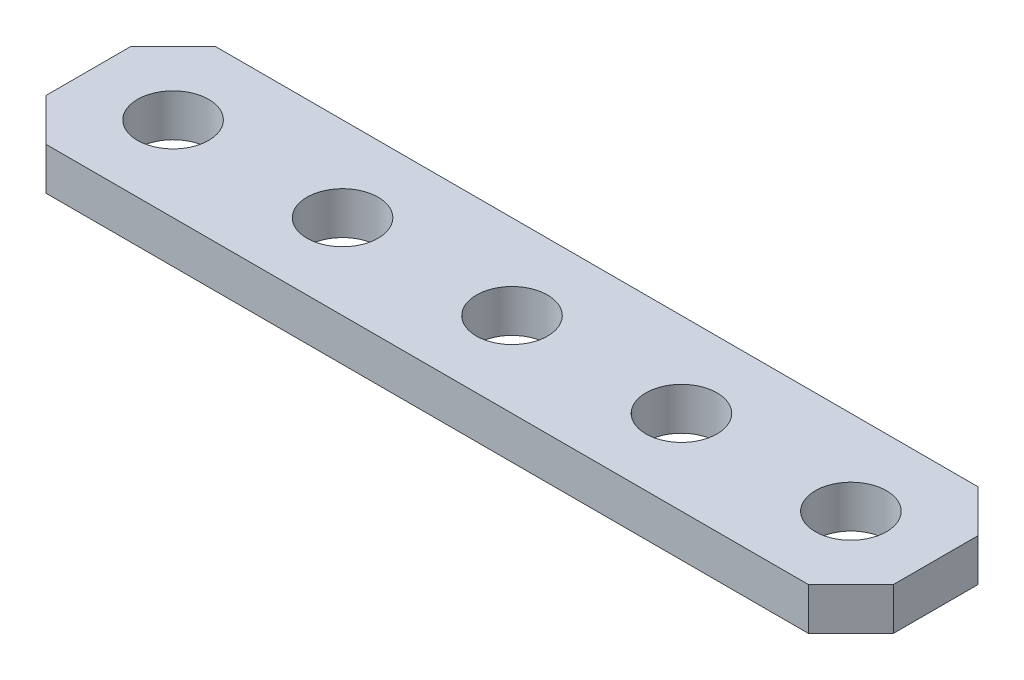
ISO-10303-21;
HEADER;
FILE_DESCRIPTION(('STEP AP214'),'2;1');
FILE_NAME('part.step','',(''),(''),'','','');
FILE_SCHEMA(('AUTOMOTIVE_DESIGN { 1 0 10303 214 1 1 1 1 }'));
ENDSEC;
DATA;
#1=APPLICATION_CONTEXT('core data for automotive mechanical design processes');
#2=APPLICATION_PROTOCOL_DEFINITION('international standard','automotive_design',2000,#1);
#3=PRODUCT_CONTEXT('',#1,'mechanical');
#4=PRODUCT('Part','Part','',(#3));
#5=PRODUCT_RELATED_PRODUCT_CATEGORY('part','',(#4));
#6=PRODUCT_DEFINITION_FORMATION('','',#4);
#7=PRODUCT_DEFINITION_CONTEXT('part definition',#1,'design');
#8=PRODUCT_DEFINITION('design','',#6,#7);
#9=PRODUCT_DEFINITION_SHAPE('','',#8);
#10=(LENGTH_UNIT() NAMED_UNIT(*) SI_UNIT(.MILLI.,.METRE.));
#11=(NAMED_UNIT(*) PLANE_ANGLE_UNIT() SI_UNIT($,.RADIAN.));
#12=(NAMED_UNIT(*) SI_UNIT($,.STERADIAN.) SOLID_ANGLE_UNIT());
#13=UNCERTAINTY_MEASURE_WITH_UNIT(LENGTH_MEASURE(1.E-05),#10,'distance_accuracy_value','');
#14=(GEOMETRIC_REPRESENTATION_CONTEXT(3) GLOBAL_UNCERTAINTY_ASSIGNED_CONTEXT((#13)) GLOBAL_UNIT_ASSIGNED_CONTEXT((#10,
#11,#12)) REPRESENTATION_CONTEXT('',''));
#15=CARTESIAN_POINT('',(0.,0.,0.));
#16=DIRECTION('',(0.,0.,1.));
#17=DIRECTION('',(1.,0.,0.));
#18=AXIS2_PLACEMENT_3D('',#15,#16,#17);
#19=CARTESIAN_POINT('',(0.,3.175,0.));
#20=DIRECTION('',(0.,0.,-1.));
#21=DIRECTION('',(0.,-1.,0.));
#22=AXIS2_PLACEMENT_3D('',#19,#20,#21);
#23=PLANE('',#22);
#24=DIRECTION('',(1.,0.,0.));
#25=VECTOR('',#24,1.);
#26=CARTESIAN_POINT('',(0.,3.175,0.));
#27=LINE('',#26,#25);
#28=CARTESIAN_POINT('',(3.175,3.175,0.));
#29=VERTEX_POINT('',#28);
#30=CARTESIAN_POINT('',(60.325,3.175,0.));
#31=VERTEX_POINT('',#30);
#32=EDGE_CURVE('E158',#29,#31,#27,.T.);
#33=ORIENTED_EDGE('',*,*,#32,.F.);
#34=DIRECTION('',(0.,-1.,0.));
#35=VECTOR('',#34,1.);
#36=CARTESIAN_POINT('',(3.175,0.,0.));
#37=LINE('',#36,#35);
#38=CARTESIAN_POINT('',(3.175,0.,0.));
#39=VERTEX_POINT('',#38);
#40=EDGE_CURVE('E157',#29,#39,#37,.T.);
#41=ORIENTED_EDGE('',*,*,#40,.T.);
#42=DIRECTION('',(1.,0.,0.));
#43=VECTOR('',#42,1.);
#44=CARTESIAN_POINT('',(0.,0.,0.));
#45=LINE('',#44,#43);
#46=CARTESIAN_POINT('',(60.325,0.,0.));
#47=VERTEX_POINT('',#46);
#48=EDGE_CURVE('E140',#39,#47,#45,.T.);
#49=ORIENTED_EDGE('',*,*,#48,.T.);
#50=DIRECTION('',(0.,1.,0.));
#51=VECTOR('',#50,1.);
#52=CARTESIAN_POINT('',(60.325,3.175,0.));
#53=LINE('',#52,#51);
#54=EDGE_CURVE('E416',#47,#31,#53,.T.);
#55=ORIENTED_EDGE('',*,*,#54,.T.);
#56=EDGE_LOOP('',(#33,#41,#49,#55));
#57=FACE_BOUND('',#56,.T.);
#58=ADVANCED_FACE('F17',(#57),#23,.F.);
#59=CARTESIAN_POINT('',(63.5,3.175,0.));
#60=DIRECTION('',(-1.,0.,0.));
#61=DIRECTION('',(0.,0.,1.));
#62=AXIS2_PLACEMENT_3D('',#59,#60,#61);
#63=PLANE('',#62);
#64=DIRECTION('',(0.,0.,-1.));
#65=VECTOR('',#64,1.);
#66=CARTESIAN_POINT('',(63.5,0.,0.));
#67=LINE('',#66,#65);
#68=CARTESIAN_POINT('',(63.5,0.,-3.175));
#69=VERTEX_POINT('',#68);
#70=CARTESIAN_POINT('',(63.5,0.,-9.525));
#71=VERTEX_POINT('',#70);
#72=EDGE_CURVE('E215',#69,#71,#67,.T.);
#73=ORIENTED_EDGE('',*,*,#72,.T.);
#74=DIRECTION('',(0.,1.,0.));
#75=VECTOR('',#74,1.);
#76=CARTESIAN_POINT('',(63.5,3.175,-9.525));
#77=LINE('',#76,#75);
#78=CARTESIAN_POINT('',(63.5,3.175,-9.525));
#79=VERTEX_POINT('',#78);
#80=EDGE_CURVE('E180',#71,#79,#77,.T.);
#81=ORIENTED_EDGE('',*,*,#80,.T.);
#82=DIRECTION('',(0.,0.,-1.));
#83=VECTOR('',#82,1.);
#84=CARTESIAN_POINT('',(63.5,3.175,0.));
#85=LINE('',#84,#83);
#86=CARTESIAN_POINT('',(63.5,3.175,-3.175));
#87=VERTEX_POINT('',#86);
#88=EDGE_CURVE('E238',#87,#79,#85,.T.);
#89=ORIENTED_EDGE('',*,*,#88,.F.);
#90=DIRECTION('',(0.,-1.,0.));
#91=VECTOR('',#90,1.);
#92=CARTESIAN_POINT('',(63.5,3.175,-3.175));
#93=LINE('',#92,#91);
#94=EDGE_CURVE('E176',#87,#69,#93,.T.);
#95=ORIENTED_EDGE('',*,*,#94,.T.);
#96=EDGE_LOOP('',(#73,#81,#89,#95));
#97=FACE_BOUND('',#96,.T.);
#98=ADVANCED_FACE('F266',(#97),#63,.F.);
#99=CARTESIAN_POINT('',(0.,3.175,-12.7));
#100=DIRECTION('',(0.,0.,-1.));
#101=DIRECTION('',(0.,-1.,0.));
#102=AXIS2_PLACEMENT_3D('',#99,#100,#101);
#103=PLANE('',#102);
#104=DIRECTION('',(1.,0.,0.));
#105=VECTOR('',#104,1.);
#106=CARTESIAN_POINT('',(0.,0.,-12.7));
#107=LINE('',#106,#105);
#108=CARTESIAN_POINT('',(3.175,0.,-12.7));
#109=VERTEX_POINT('',#108);
#110=CARTESIAN_POINT('',(60.325,0.,-12.7));
#111=VERTEX_POINT('',#110);
#112=EDGE_CURVE('E213',#109,#111,#107,.T.);
#113=ORIENTED_EDGE('',*,*,#112,.F.);
#114=DIRECTION('',(0.,1.,0.));
#115=VECTOR('',#114,1.);
#116=CARTESIAN_POINT('',(3.175,3.175,-12.7));
#117=LINE('',#116,#115);
#118=CARTESIAN_POINT('',(3.175,3.175,-12.7));
#119=VERTEX_POINT('',#118);
#120=EDGE_CURVE('E201',#109,#119,#117,.T.);
#121=ORIENTED_EDGE('',*,*,#120,.T.);
#122=DIRECTION('',(1.,0.,0.));
#123=VECTOR('',#122,1.);
#124=CARTESIAN_POINT('',(0.,3.175,-12.7));
#125=LINE('',#124,#123);
#126=CARTESIAN_POINT('',(60.325,3.175,-12.7));
#127=VERTEX_POINT('',#126);
#128=EDGE_CURVE('E241',#119,#127,#125,.T.);
#129=ORIENTED_EDGE('',*,*,#128,.T.);
#130=DIRECTION('',(0.,-1.,0.));
#131=VECTOR('',#130,1.);
#132=CARTESIAN_POINT('',(60.325,0.,-12.7));
#133=LINE('',#132,#131);
#134=EDGE_CURVE('E193',#127,#111,#133,.T.);
#135=ORIENTED_EDGE('',*,*,#134,.T.);
#136=EDGE_LOOP('',(#113,#121,#129,#135));
#137=FACE_BOUND('',#136,.T.);
#138=ADVANCED_FACE('F273',(#137),#103,.T.);
#139=CARTESIAN_POINT('',(0.,3.175,0.));
#140=DIRECTION('',(-1.,0.,0.));
#141=DIRECTION('',(0.,0.,1.));
#142=AXIS2_PLACEMENT_3D('',#139,#140,#141);
#143=PLANE('',#142);
#144=DIRECTION('',(0.,0.,-1.));
#145=VECTOR('',#144,1.);
#146=CARTESIAN_POINT('',(0.,0.,0.));
#147=LINE('',#146,#145);
#148=CARTESIAN_POINT('',(0.,0.,-3.175));
#149=VERTEX_POINT('',#148);
#150=CARTESIAN_POINT('',(0.,0.,-9.525));
#151=VERTEX_POINT('',#150);
#152=EDGE_CURVE('E153',#149,#151,#147,.T.);
#153=ORIENTED_EDGE('',*,*,#152,.F.);
#154=DIRECTION('',(0.,1.,0.));
#155=VECTOR('',#154,1.);
#156=CARTESIAN_POINT('',(0.,3.175,-3.175));
#157=LINE('',#156,#155);
#158=CARTESIAN_POINT('',(0.,3.175,-3.175));
#159=VERTEX_POINT('',#158);
#160=EDGE_CURVE('E166',#149,#159,#157,.T.);
#161=ORIENTED_EDGE('',*,*,#160,.T.);
#162=DIRECTION('',(0.,0.,-1.));
#163=VECTOR('',#162,1.);
#164=CARTESIAN_POINT('',(0.,3.175,0.));
#165=LINE('',#164,#163);
#166=CARTESIAN_POINT('',(0.,3.175,-9.525));
#167=VERTEX_POINT('',#166);
#168=EDGE_CURVE('E229',#159,#167,#165,.T.);
#169=ORIENTED_EDGE('',*,*,#168,.T.);
#170=DIRECTION('',(0.,-1.,0.));
#171=VECTOR('',#170,1.);
#172=CARTESIAN_POINT('',(0.,3.175,-9.525));
#173=LINE('',#172,#171);
#174=EDGE_CURVE('E212',#167,#151,#173,.T.);
#175=ORIENTED_EDGE('',*,*,#174,.T.);
#176=EDGE_LOOP('',(#153,#161,#169,#175));
#177=FACE_BOUND('',#176,.T.);
#178=ADVANCED_FACE('F19',(#177),#143,.T.);
#179=CARTESIAN_POINT('',(19.05,3.175,-6.35));
#180=DIRECTION('',(0.,-1.,0.));
#181=DIRECTION('',(0.,0.,-1.));
#182=AXIS2_PLACEMENT_3D('',#179,#180,#181);
#183=CYLINDRICAL_SURFACE('',#182,2.667);
#184=CARTESIAN_POINT('',(19.05,3.175,-6.35));
#185=DIRECTION('',(0.,1.,0.));
#186=DIRECTION('',(0.,0.,1.));
#187=AXIS2_PLACEMENT_3D('',#184,#185,#186);
#188=CIRCLE('',#187,2.667);
#189=CARTESIAN_POINT('',(19.05,3.175,-3.683));
#190=VERTEX_POINT('',#189);
#191=EDGE_CURVE('E235',#190,#190,#188,.T.);
#192=ORIENTED_EDGE('',*,*,#191,.T.);
#193=EDGE_LOOP('',(#192));
#194=FACE_BOUND('',#193,.T.);
#195=CARTESIAN_POINT('',(19.05,0.,-6.35));
#196=DIRECTION('',(0.,1.,0.));
#197=DIRECTION('',(0.,0.,1.));
#198=AXIS2_PLACEMENT_3D('',#195,#196,#197);
#199=CIRCLE('',#198,2.667);
#200=CARTESIAN_POINT('',(19.05,0.,-3.683));
#201=VERTEX_POINT('',#200);
#202=EDGE_CURVE('E192',#201,#201,#199,.T.);
#203=ORIENTED_EDGE('',*,*,#202,.F.);
#204=EDGE_LOOP('',(#203));
#205=FACE_BOUND('',#204,.T.);
#206=ADVANCED_FACE('F341',(#194,#205),#183,.F.);
#207=CARTESIAN_POINT('',(6.35,3.175,-6.35));
#208=DIRECTION('',(0.,-1.,0.));
#209=DIRECTION('',(0.,0.,-1.));
#210=AXIS2_PLACEMENT_3D('',#207,#208,#209);
#211=CYLINDRICAL_SURFACE('',#210,2.667);
#212=CARTESIAN_POINT('',(6.35,3.175,-6.35));
#213=DIRECTION('',(0.,1.,0.));
#214=DIRECTION('',(0.,0.,1.));
#215=AXIS2_PLACEMENT_3D('',#212,#213,#214);
#216=CIRCLE('',#215,2.667);
#217=CARTESIAN_POINT('',(6.35,3.175,-3.683));
#218=VERTEX_POINT('',#217);
#219=EDGE_CURVE('E232',#218,#218,#216,.T.);
#220=ORIENTED_EDGE('',*,*,#219,.T.);
#221=EDGE_LOOP('',(#220));
#222=FACE_BOUND('',#221,.T.);
#223=CARTESIAN_POINT('',(6.35,0.,-6.35));
#224=DIRECTION('',(0.,1.,0.));
#225=DIRECTION('',(0.,0.,1.));
#226=AXIS2_PLACEMENT_3D('',#223,#224,#225);
#227=CIRCLE('',#226,2.667);
#228=CARTESIAN_POINT('',(6.35,0.,-3.683));
#229=VERTEX_POINT('',#228);
#230=EDGE_CURVE('E188',#229,#229,#227,.T.);
#231=ORIENTED_EDGE('',*,*,#230,.F.);
#232=EDGE_LOOP('',(#231));
#233=FACE_BOUND('',#232,.T.);
#234=ADVANCED_FACE('F333',(#222,#233),#211,.F.);
#235=CARTESIAN_POINT('',(57.15,3.175,-6.35));
#236=DIRECTION('',(0.,-1.,0.));
#237=DIRECTION('',(0.,0.,-1.));
#238=AXIS2_PLACEMENT_3D('',#235,#236,#237);
#239=CYLINDRICAL_SURFACE('',#238,2.667);
#240=CARTESIAN_POINT('',(57.15,3.175,-6.35));
#241=DIRECTION('',(0.,-1.,0.));
#242=DIRECTION('',(0.,0.,1.));
#243=AXIS2_PLACEMENT_3D('',#240,#241,#242);
#244=CIRCLE('',#243,2.667);
#245=CARTESIAN_POINT('',(57.15,3.175,-3.683));
#246=VERTEX_POINT('',#245);
#247=EDGE_CURVE('E26',#246,#246,#244,.T.);
#248=ORIENTED_EDGE('',*,*,#247,.F.);
#249=EDGE_LOOP('',(#248));
#250=FACE_BOUND('',#249,.T.);
#251=CARTESIAN_POINT('',(57.15,0.,-6.35));
#252=DIRECTION('',(0.,-1.,0.));
#253=DIRECTION('',(0.,0.,1.));
#254=AXIS2_PLACEMENT_3D('',#251,#252,#253);
#255=CIRCLE('',#254,2.667);
#256=CARTESIAN_POINT('',(57.15,0.,-3.683));
#257=VERTEX_POINT('',#256);
#258=EDGE_CURVE('E191',#257,#257,#255,.T.);
#259=ORIENTED_EDGE('',*,*,#258,.T.);
#260=EDGE_LOOP('',(#259));
#261=FACE_BOUND('',#260,.T.);
#262=ADVANCED_FACE('F326',(#250,#261),#239,.F.);
#263=CARTESIAN_POINT('',(31.75,3.175,-6.35));
#264=DIRECTION('',(0.,-1.,0.));
#265=DIRECTION('',(0.,0.,-1.));
#266=AXIS2_PLACEMENT_3D('',#263,#264,#265);
#267=CYLINDRICAL_SURFACE('',#266,2.667);
#268=CARTESIAN_POINT('',(31.75,3.175,-6.35));
#269=DIRECTION('',(0.,1.,0.));
#270=DIRECTION('',(0.,0.,1.));
#271=AXIS2_PLACEMENT_3D('',#268,#269,#270);
#272=CIRCLE('',#271,2.667);
#273=CARTESIAN_POINT('',(31.75,3.175,-3.683));
#274=VERTEX_POINT('',#273);
#275=EDGE_CURVE('E11',#274,#274,#272,.T.);
#276=ORIENTED_EDGE('',*,*,#275,.T.);
#277=EDGE_LOOP('',(#276));
#278=FACE_BOUND('',#277,.T.);
#279=CARTESIAN_POINT('',(31.75,0.,-6.35));
#280=DIRECTION('',(0.,1.,0.));
#281=DIRECTION('',(0.,0.,1.));
#282=AXIS2_PLACEMENT_3D('',#279,#280,#281);
#283=CIRCLE('',#282,2.667);
#284=CARTESIAN_POINT('',(31.75,0.,-3.683));
#285=VERTEX_POINT('',#284);
#286=EDGE_CURVE('E206',#285,#285,#283,.T.);
#287=ORIENTED_EDGE('',*,*,#286,.F.);
#288=EDGE_LOOP('',(#287));
#289=FACE_BOUND('',#288,.T.);
#290=ADVANCED_FACE('F291',(#278,#289),#267,.F.);
#291=CARTESIAN_POINT('',(44.45,3.175,-6.35));
#292=DIRECTION('',(0.,-1.,0.));
#293=DIRECTION('',(0.,0.,-1.));
#294=AXIS2_PLACEMENT_3D('',#291,#292,#293);
#295=CYLINDRICAL_SURFACE('',#294,2.667);
#296=CARTESIAN_POINT('',(44.45,3.175,-6.35));
#297=DIRECTION('',(0.,-1.,0.));
#298=DIRECTION('',(0.,0.,1.));
#299=AXIS2_PLACEMENT_3D('',#296,#297,#298);
#300=CIRCLE('',#299,2.667);
#301=CARTESIAN_POINT('',(44.45,3.175,-3.683));
#302=VERTEX_POINT('',#301);
#303=EDGE_CURVE('E209',#302,#302,#300,.T.);
#304=ORIENTED_EDGE('',*,*,#303,.F.);
#305=EDGE_LOOP('',(#304));
#306=FACE_BOUND('',#305,.T.);
#307=CARTESIAN_POINT('',(44.45,0.,-6.35));
#308=DIRECTION('',(0.,-1.,0.));
#309=DIRECTION('',(0.,0.,1.));
#310=AXIS2_PLACEMENT_3D('',#307,#308,#309);
#311=CIRCLE('',#310,2.667);
#312=CARTESIAN_POINT('',(44.45,0.,-3.683));
#313=VERTEX_POINT('',#312);
#314=EDGE_CURVE('E154',#313,#313,#311,.T.);
#315=ORIENTED_EDGE('',*,*,#314,.T.);
#316=EDGE_LOOP('',(#315));
#317=FACE_BOUND('',#316,.T.);
#318=ADVANCED_FACE('F286',(#306,#317),#295,.F.);
#319=CARTESIAN_POINT('',(0.,3.175,0.));
#320=DIRECTION('',(0.,1.,0.));
#321=DIRECTION('',(1.,0.,0.));
#322=AXIS2_PLACEMENT_3D('',#319,#320,#321);
#323=PLANE('',#322);
#324=ORIENTED_EDGE('',*,*,#275,.F.);
#325=EDGE_LOOP('',(#324));
#326=FACE_BOUND('',#325,.T.);
#327=ORIENTED_EDGE('',*,*,#247,.T.);
#328=EDGE_LOOP('',(#327));
#329=FACE_BOUND('',#328,.T.);
#330=ORIENTED_EDGE('',*,*,#219,.F.);
#331=EDGE_LOOP('',(#330));
#332=FACE_BOUND('',#331,.T.);
#333=ORIENTED_EDGE('',*,*,#191,.F.);
#334=EDGE_LOOP('',(#333));
#335=FACE_BOUND('',#334,.T.);
#336=ORIENTED_EDGE('',*,*,#168,.F.);
#337=DIRECTION('',(0.707106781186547,0.,0.707106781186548));
#338=VECTOR('',#337,1.);
#339=CARTESIAN_POINT('',(1.5875,3.175,-1.5875));
#340=LINE('',#339,#338);
#341=EDGE_CURVE('E172',#159,#29,#340,.T.);
#342=ORIENTED_EDGE('',*,*,#341,.T.);
#343=ORIENTED_EDGE('',*,*,#32,.T.);
#344=DIRECTION('',(0.707106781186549,0.,-0.707106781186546));
#345=VECTOR('',#344,1.);
#346=CARTESIAN_POINT('',(30.1625,3.175,30.1625));
#347=LINE('',#346,#345);
#348=EDGE_CURVE('E418',#31,#87,#347,.T.);
#349=ORIENTED_EDGE('',*,*,#348,.T.);
#350=ORIENTED_EDGE('',*,*,#88,.T.);
#351=DIRECTION('',(-0.707106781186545,0.,-0.70710678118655));
#352=VECTOR('',#351,1.);
#353=CARTESIAN_POINT('',(36.5125,3.175,-36.5125));
#354=LINE('',#353,#352);
#355=EDGE_CURVE('E179',#79,#127,#354,.T.);
#356=ORIENTED_EDGE('',*,*,#355,.T.);
#357=ORIENTED_EDGE('',*,*,#128,.F.);
#358=DIRECTION('',(-0.707106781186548,0.,0.707106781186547));
#359=VECTOR('',#358,1.);
#360=CARTESIAN_POINT('',(-4.7625,3.175,-4.7625));
#361=LINE('',#360,#359);
#362=EDGE_CURVE('E197',#119,#167,#361,.T.);
#363=ORIENTED_EDGE('',*,*,#362,.T.);
#364=EDGE_LOOP('',(#336,#342,#343,#349,#350,#356,#357,#363));
#365=FACE_BOUND('',#364,.T.);
#366=ORIENTED_EDGE('',*,*,#303,.T.);
#367=EDGE_LOOP('',(#366));
#368=FACE_BOUND('',#367,.T.);
#369=ADVANCED_FACE('F290',(#326,#329,#332,#335,#365,#368),#323,.T.);
#370=CARTESIAN_POINT('',(0.,0.,0.));
#371=DIRECTION('',(0.,1.,0.));
#372=DIRECTION('',(1.,0.,0.));
#373=AXIS2_PLACEMENT_3D('',#370,#371,#372);
#374=PLANE('',#373);
#375=ORIENTED_EDGE('',*,*,#286,.T.);
#376=EDGE_LOOP('',(#375));
#377=FACE_BOUND('',#376,.T.);
#378=ORIENTED_EDGE('',*,*,#258,.F.);
#379=EDGE_LOOP('',(#378));
#380=FACE_BOUND('',#379,.T.);
#381=ORIENTED_EDGE('',*,*,#230,.T.);
#382=EDGE_LOOP('',(#381));
#383=FACE_BOUND('',#382,.T.);
#384=ORIENTED_EDGE('',*,*,#202,.T.);
#385=EDGE_LOOP('',(#384));
#386=FACE_BOUND('',#385,.T.);
#387=ORIENTED_EDGE('',*,*,#48,.F.);
#388=DIRECTION('',(-0.707106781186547,0.,-0.707106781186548));
#389=VECTOR('',#388,1.);
#390=CARTESIAN_POINT('',(3.175,0.,0.));
#391=LINE('',#390,#389);
#392=EDGE_CURVE('E145',#39,#149,#391,.T.);
#393=ORIENTED_EDGE('',*,*,#392,.T.);
#394=ORIENTED_EDGE('',*,*,#152,.T.);
#395=DIRECTION('',(0.707106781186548,0.,-0.707106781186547));
#396=VECTOR('',#395,1.);
#397=CARTESIAN_POINT('',(0.,0.,-9.525));
#398=LINE('',#397,#396);
#399=EDGE_CURVE('E205',#151,#109,#398,.T.);
#400=ORIENTED_EDGE('',*,*,#399,.T.);
#401=ORIENTED_EDGE('',*,*,#112,.T.);
#402=DIRECTION('',(0.707106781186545,0.,0.70710678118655));
#403=VECTOR('',#402,1.);
#404=CARTESIAN_POINT('',(60.325,0.,-12.7));
#405=LINE('',#404,#403);
#406=EDGE_CURVE('E184',#111,#71,#405,.T.);
#407=ORIENTED_EDGE('',*,*,#406,.T.);
#408=ORIENTED_EDGE('',*,*,#72,.F.);
#409=DIRECTION('',(-0.707106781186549,0.,0.707106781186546));
#410=VECTOR('',#409,1.);
#411=CARTESIAN_POINT('',(63.5,0.,-3.175));
#412=LINE('',#411,#410);
#413=EDGE_CURVE('E148',#69,#47,#412,.T.);
#414=ORIENTED_EDGE('',*,*,#413,.T.);
#415=EDGE_LOOP('',(#387,#393,#394,#400,#401,#407,#408,#414));
#416=FACE_BOUND('',#415,.T.);
#417=ORIENTED_EDGE('',*,*,#314,.F.);
#418=EDGE_LOOP('',(#417));
#419=FACE_BOUND('',#418,.T.);
#420=ADVANCED_FACE('F142',(#377,#380,#383,#386,#416,#419),#374,.F.);
#421=CARTESIAN_POINT('',(3.175,3.175,0.));
#422=DIRECTION('',(-0.707106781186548,0.,0.707106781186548));
#423=DIRECTION('',(0.,1.,0.));
#424=AXIS2_PLACEMENT_3D('',#421,#422,#423);
#425=PLANE('',#424);
#426=ORIENTED_EDGE('',*,*,#341,.F.);
#427=ORIENTED_EDGE('',*,*,#160,.F.);
#428=ORIENTED_EDGE('',*,*,#392,.F.);
#429=ORIENTED_EDGE('',*,*,#40,.F.);
#430=EDGE_LOOP('',(#426,#427,#428,#429));
#431=FACE_BOUND('',#430,.T.);
#432=ADVANCED_FACE('F164',(#431),#425,.T.);
#433=CARTESIAN_POINT('',(0.,3.175,-9.525));
#434=DIRECTION('',(0.707106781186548,0.,0.707106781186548));
#435=DIRECTION('',(0.,-1.,0.));
#436=AXIS2_PLACEMENT_3D('',#433,#434,#435);
#437=PLANE('',#436);
#438=ORIENTED_EDGE('',*,*,#362,.F.);
#439=ORIENTED_EDGE('',*,*,#120,.F.);
#440=ORIENTED_EDGE('',*,*,#399,.F.);
#441=ORIENTED_EDGE('',*,*,#174,.F.);
#442=EDGE_LOOP('',(#438,#439,#440,#441));
#443=FACE_BOUND('',#442,.T.);
#444=ADVANCED_FACE('F281',(#443),#437,.F.);
#445=CARTESIAN_POINT('',(60.325,3.175,-12.7));
#446=DIRECTION('',(0.707106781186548,0.,-0.707106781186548));
#447=DIRECTION('',(0.,-1.,0.));
#448=AXIS2_PLACEMENT_3D('',#445,#446,#447);
#449=PLANE('',#448);
#450=ORIENTED_EDGE('',*,*,#355,.F.);
#451=ORIENTED_EDGE('',*,*,#80,.F.);
#452=ORIENTED_EDGE('',*,*,#406,.F.);
#453=ORIENTED_EDGE('',*,*,#134,.F.);
#454=EDGE_LOOP('',(#450,#451,#452,#453));
#455=FACE_BOUND('',#454,.T.);
#456=ADVANCED_FACE('F257',(#455),#449,.T.);
#457=CARTESIAN_POINT('',(63.5,3.175,-3.175));
#458=DIRECTION('',(-0.707106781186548,0.,-0.707106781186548));
#459=DIRECTION('',(-0.707106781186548,0.,0.707106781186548));
#460=AXIS2_PLACEMENT_3D('',#457,#458,#459);
#461=PLANE('',#460);
#462=ORIENTED_EDGE('',*,*,#348,.F.);
#463=ORIENTED_EDGE('',*,*,#54,.F.);
#464=ORIENTED_EDGE('',*,*,#413,.F.);
#465=ORIENTED_EDGE('',*,*,#94,.F.);
#466=EDGE_LOOP('',(#462,#463,#464,#465));
#467=FACE_BOUND('',#466,.T.);
#468=ADVANCED_FACE('F252',(#467),#461,.F.);
#469=CLOSED_SHELL('',(#58,#98,#138,#178,#206,#234,#262,#290,#318,#369,#420,#432,#444,#456,#468));
#470=MANIFOLD_SOLID_BREP('B1',#469);
#471=ADVANCED_BREP_SHAPE_REPRESENTATION('',(#18,#470),#14);
#472=SHAPE_DEFINITION_REPRESENTATION(#9,#471);
ENDSEC;
END-ISO-10303-21;
